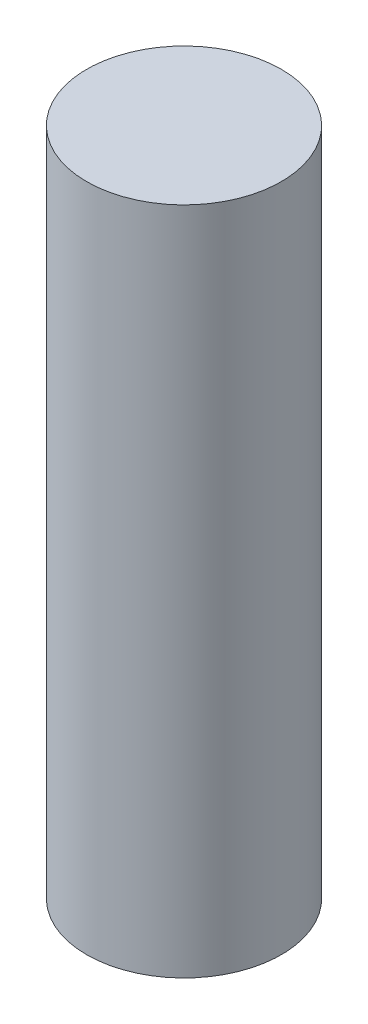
from build123d import *

# Parameters (mm, degrees)
SKETCH1_R           = 2.4003
BOSS_EXTRUDE1_DEPTH = 16.51


with BuildPart() as part:
    # Sketch1 → Boss-Extrude1 (new body)
    with BuildSketch(Plane(origin=(0, 0, 0), x_dir=(1, 0, 0), z_dir=(0, 1, 0))):
        with Locations(Location((0, 0, 0), (0, 0, 270))):
            Circle(SKETCH1_R)
    extrude(amount=BOSS_EXTRUDE1_DEPTH)


solid = part.part
